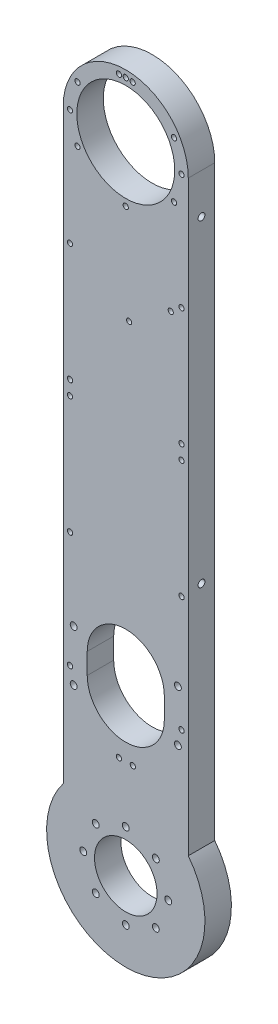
from build123d import *

# Parameters (mm, degrees)
BOSS_EXTRUDE1_DEPTH          = 12.7
CUT_EXTRUDE1_DEPTH           = 338.387447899
HOLE1_D                      = 30
HOLE2_D                      = 47
F_39_0_0995_DIAMETER_HOLE1_D = 2.5273
F_4_CLEARANCE_HOLE1_D        = 3.3
F_2_CLEARANCE_HOLE1_D        = 2.499999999
F_4_CLEARANCE_HOLE2_D        = 3.3
F_4_CLEARANCE_HOLE2_DEPTH    = 10


with BuildPart() as part:
    # Sketch1 → Boss-Extrude1 (new body)
    with BuildSketch(Plane.XY.offset(12.7)):
        with BuildLine():
            Line((-30, 305), (-30, 23.323807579))
            ThreePointArc((-30, 23.323807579), (0, -38), (30, 23.323807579))
            Line((30, 23.323807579), (30, 305))
            ThreePointArc((30, 305), (0, 335), (-30, 305))
        make_face()
    extrude(amount=-BOSS_EXTRUDE1_DEPTH)

    # Sketch2 → Cut-Extrude1 (cut, through all)
    with BuildSketch(Plane(origin=(0, 0, 0), x_dir=(-1, 0, 0), z_dir=(0, 0, -1))):
        with BuildLine():
            Line((18.5, 74.022471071), (18.5, 84.022471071))
            ThreePointArc((18.5, 84.022471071), (0, 102.522471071), (-18.5, 84.022471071))
            Line((-18.5, 84.022471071), (-18.5, 74.022471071))
            ThreePointArc((-18.5, 74.022471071), (0, 55.522471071), (18.5, 74.022471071))
        make_face()
    extrude(amount=-CUT_EXTRUDE1_DEPTH, mode=Mode.SUBTRACT)

    # Hole1 (through all)
    with Locations(Plane.XY.offset(12.7)):
        with Locations((0, 0)):
            Hole(HOLE1_D / 2)

    # Hole2 (through all)
    with Locations(Plane.XY.offset(12.7)):
        with Locations((0, 305)):
            Hole(HOLE2_D / 2)

    # 39 _0.0995_ Diameter Hole1 (through all)
    with Locations(Plane.XY.offset(12.7)):
        with Locations((-26.75, 74.022471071), (-26.75, 129.511235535), (-26.75, 186.111235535), (-26.750000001, 192.911235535), (-26.750000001, 249.511235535), (-26.750000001, 305), (-3.300000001, 331.545668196), (3.299999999, 331.545668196), (26.749999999, 305), (26.749999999, 249.511235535), (26.749999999, 192.911235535), (26.75, 186.111235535), (26.75, 129.511235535), (26.75, 74.022471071), (3.4, 47.489425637), (-3.3, 47.476802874), (-23.166179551, 318.375), (-23.166179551, 291.625), (0, 278.25), (23.166179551, 291.625), (23.166179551, 318.375), (0, 331.75)):
            Hole(F_39_0_0995_DIAMETER_HOLE1_D / 2)

    # 4 Clearance Hole1 (through all)
    with Locations(Plane(origin=(0, 0, 0), x_dir=(-1, 0, 0), z_dir=(0, 0, -1))):
        with Locations((25, 66.772471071), (25, 91.272471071), (-25, 66.772471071), (-25, 91.272471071), (14.424978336, 14.424978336), (20.4, 0), (14.424978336, -14.424978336), (0, -20.4), (-14.424978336, -14.424978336), (-20.4, 0), (-14.424978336, 14.424978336), (0, 20.4)):
            Hole(F_4_CLEARANCE_HOLE1_D / 2)

    # 2 Clearance Hole1 (through all)
    with Locations(Plane(origin=(0, 0, 0), x_dir=(-1, 0, 0), z_dir=(0, 0, -1))):
        with Locations((-1.619921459, 231.265288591), (-21.578861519, 245.43367635)):
            Hole(F_2_CLEARANCE_HOLE1_D / 2)

    # 4 Clearance Hole2
    with Locations(Plane(origin=(30, 0, 0), x_dir=(0, 0, -1), z_dir=(1, 0, 0))):
        with Locations((-6.35, 285.723807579), (-6.35, 133.323807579)):
            Hole(F_4_CLEARANCE_HOLE2_D / 2, depth=F_4_CLEARANCE_HOLE2_DEPTH)


solid = part.part
